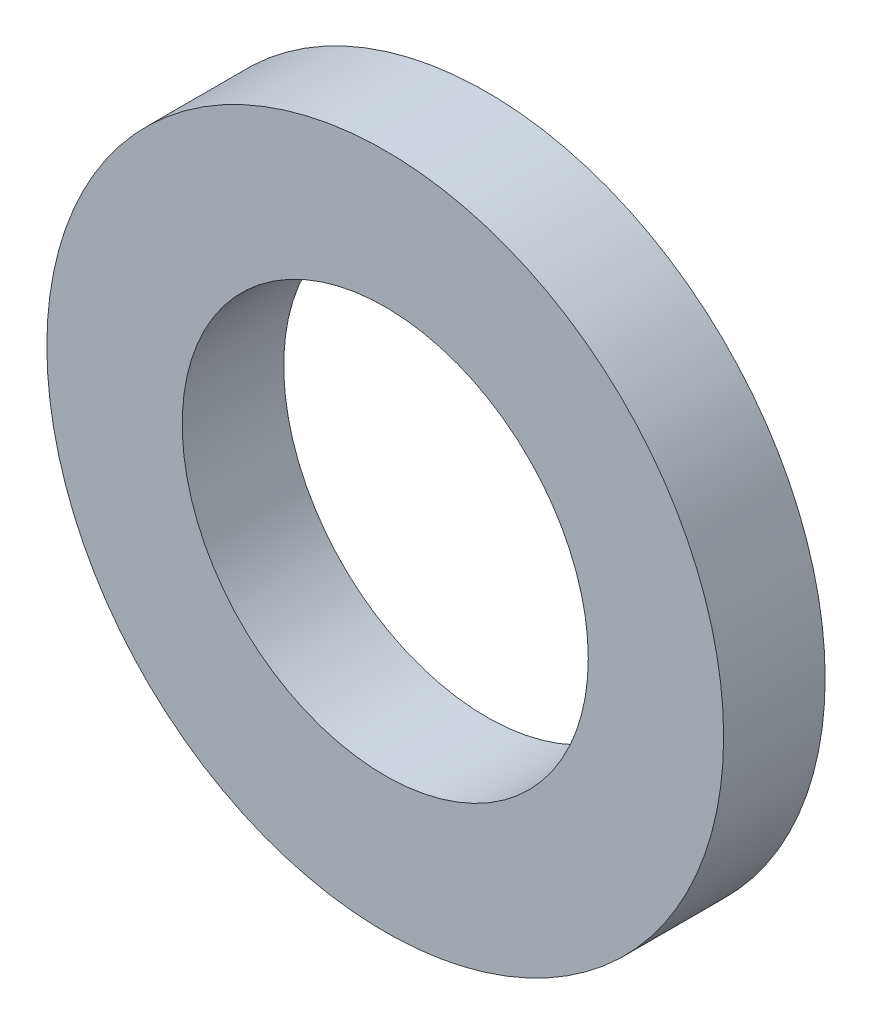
from build123d import *

# Parameters (mm, degrees)
ESQUISSE1_R          = 10
ESQUISSE1_R_2        = 6
BASE_EXTRUSION_DEPTH = 3


with BuildPart() as part:
    # Esquisse1 → Base-Extrusion (new body)
    with BuildSketch(Plane.XY):
        Circle(ESQUISSE1_R)
        Circle(ESQUISSE1_R_2, mode=Mode.SUBTRACT)
    extrude(amount=BASE_EXTRUSION_DEPTH)


solid = part.part
